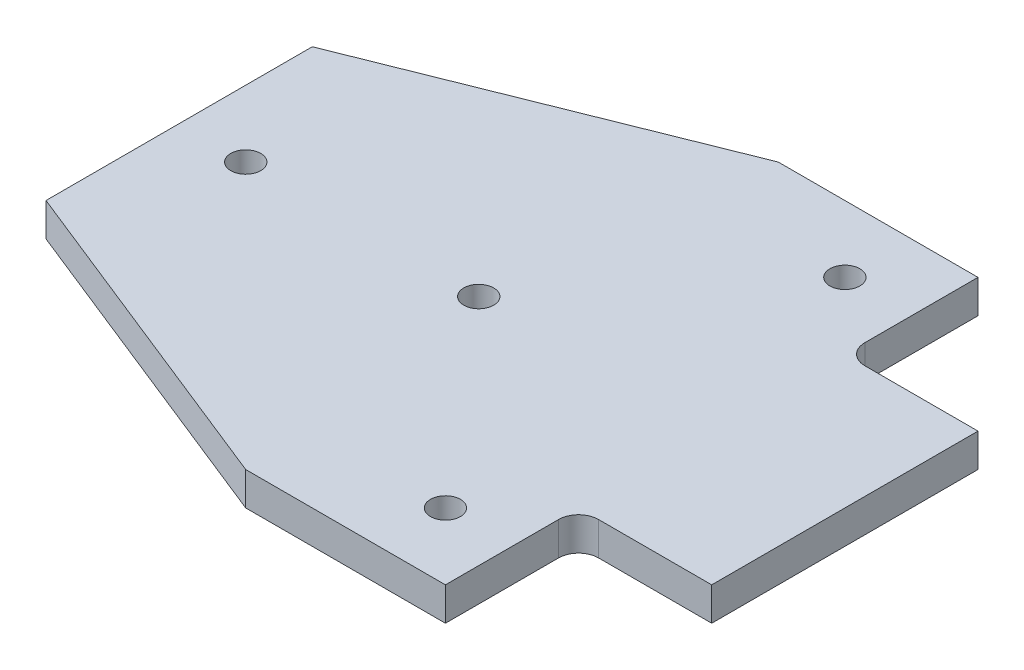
ISO-10303-21;
HEADER;
FILE_DESCRIPTION(('STEP AP214'),'2;1');
FILE_NAME('part.step','',(''),(''),'','','');
FILE_SCHEMA(('AUTOMOTIVE_DESIGN { 1 0 10303 214 1 1 1 1 }'));
ENDSEC;
DATA;
#1=APPLICATION_CONTEXT('core data for automotive mechanical design processes');
#2=APPLICATION_PROTOCOL_DEFINITION('international standard','automotive_design',2000,#1);
#3=PRODUCT_CONTEXT('',#1,'mechanical');
#4=PRODUCT('Part','Part','',(#3));
#5=PRODUCT_RELATED_PRODUCT_CATEGORY('part','',(#4));
#6=PRODUCT_DEFINITION_FORMATION('','',#4);
#7=PRODUCT_DEFINITION_CONTEXT('part definition',#1,'design');
#8=PRODUCT_DEFINITION('design','',#6,#7);
#9=PRODUCT_DEFINITION_SHAPE('','',#8);
#10=(LENGTH_UNIT() NAMED_UNIT(*) SI_UNIT(.MILLI.,.METRE.));
#11=(NAMED_UNIT(*) PLANE_ANGLE_UNIT() SI_UNIT($,.RADIAN.));
#12=(NAMED_UNIT(*) SI_UNIT($,.STERADIAN.) SOLID_ANGLE_UNIT());
#13=UNCERTAINTY_MEASURE_WITH_UNIT(LENGTH_MEASURE(1.E-05),#10,'distance_accuracy_value','');
#14=(GEOMETRIC_REPRESENTATION_CONTEXT(3) GLOBAL_UNCERTAINTY_ASSIGNED_CONTEXT((#13)) GLOBAL_UNIT_ASSIGNED_CONTEXT((#10,
#11,#12)) REPRESENTATION_CONTEXT('',''));
#15=CARTESIAN_POINT('',(0.,0.,0.));
#16=DIRECTION('',(0.,0.,1.));
#17=DIRECTION('',(1.,0.,0.));
#18=AXIS2_PLACEMENT_3D('',#15,#16,#17);
#19=CARTESIAN_POINT('',(83.,5.,-23.));
#20=DIRECTION('',(0.,-1.,0.));
#21=DIRECTION('',(0.,0.,-1.));
#22=AXIS2_PLACEMENT_3D('',#19,#20,#21);
#23=PLANE('',#22);
#24=CARTESIAN_POINT('',(70.,5.,-30.));
#25=DIRECTION('',(0.,1.,0.));
#26=DIRECTION('',(0.,0.,1.));
#27=AXIS2_PLACEMENT_3D('',#24,#25,#26);
#28=CIRCLE('',#27,2.25);
#29=CARTESIAN_POINT('',(70.,5.,-27.75));
#30=VERTEX_POINT('',#29);
#31=EDGE_CURVE('E290',#30,#30,#28,.T.);
#32=ORIENTED_EDGE('',*,*,#31,.F.);
#33=EDGE_LOOP('',(#32));
#34=FACE_BOUND('',#33,.T.);
#35=CARTESIAN_POINT('',(45.,5.,0.));
#36=DIRECTION('',(0.,1.,0.));
#37=DIRECTION('',(0.,0.,1.));
#38=AXIS2_PLACEMENT_3D('',#35,#36,#37);
#39=CIRCLE('',#38,2.25);
#40=CARTESIAN_POINT('',(45.,5.,2.25));
#41=VERTEX_POINT('',#40);
#42=EDGE_CURVE('E156',#41,#41,#39,.T.);
#43=ORIENTED_EDGE('',*,*,#42,.F.);
#44=EDGE_LOOP('',(#43));
#45=FACE_BOUND('',#44,.T.);
#46=DIRECTION('',(-1.,0.,0.));
#47=VECTOR('',#46,1.);
#48=CARTESIAN_POINT('',(100.,5.,-20.));
#49=LINE('',#48,#47);
#50=CARTESIAN_POINT('',(100.,5.,-20.));
#51=VERTEX_POINT('',#50);
#52=CARTESIAN_POINT('',(83.,5.,-20.));
#53=VERTEX_POINT('',#52);
#54=EDGE_CURVE('E175',#51,#53,#49,.T.);
#55=ORIENTED_EDGE('',*,*,#54,.T.);
#56=CARTESIAN_POINT('',(83.,5.,-23.));
#57=DIRECTION('',(0.,-1.,0.));
#58=DIRECTION('',(0.,0.,-1.));
#59=AXIS2_PLACEMENT_3D('',#56,#57,#58);
#60=CIRCLE('',#59,3.00000000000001);
#61=CARTESIAN_POINT('',(80.,5.,-23.));
#62=VERTEX_POINT('',#61);
#63=EDGE_CURVE('E103',#53,#62,#60,.T.);
#64=ORIENTED_EDGE('',*,*,#63,.T.);
#65=DIRECTION('',(0.,0.,-1.));
#66=VECTOR('',#65,1.);
#67=CARTESIAN_POINT('',(80.,5.,-23.));
#68=LINE('',#67,#66);
#69=CARTESIAN_POINT('',(80.,5.,-40.));
#70=VERTEX_POINT('',#69);
#71=EDGE_CURVE('E202',#62,#70,#68,.T.);
#72=ORIENTED_EDGE('',*,*,#71,.T.);
#73=DIRECTION('',(-1.,0.,0.));
#74=VECTOR('',#73,1.);
#75=CARTESIAN_POINT('',(80.,5.,-40.));
#76=LINE('',#75,#74);
#77=CARTESIAN_POINT('',(50.,5.,-40.));
#78=VERTEX_POINT('',#77);
#79=EDGE_CURVE('E221',#70,#78,#76,.T.);
#80=ORIENTED_EDGE('',*,*,#79,.T.);
#81=DIRECTION('',(-0.928476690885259,0.,0.371390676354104));
#82=VECTOR('',#81,1.);
#83=CARTESIAN_POINT('',(50.,5.,-40.));
#84=LINE('',#83,#82);
#85=CARTESIAN_POINT('',(0.,5.,-20.));
#86=VERTEX_POINT('',#85);
#87=EDGE_CURVE('E218',#78,#86,#84,.T.);
#88=ORIENTED_EDGE('',*,*,#87,.T.);
#89=DIRECTION('',(0.,0.,1.));
#90=VECTOR('',#89,1.);
#91=CARTESIAN_POINT('',(0.,5.,-20.));
#92=LINE('',#91,#90);
#93=CARTESIAN_POINT('',(0.,5.,20.));
#94=VERTEX_POINT('',#93);
#95=EDGE_CURVE('E220',#86,#94,#92,.T.);
#96=ORIENTED_EDGE('',*,*,#95,.T.);
#97=DIRECTION('',(0.928476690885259,0.,0.371390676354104));
#98=VECTOR('',#97,1.);
#99=CARTESIAN_POINT('',(50.,5.,40.));
#100=LINE('',#99,#98);
#101=CARTESIAN_POINT('',(50.,5.,40.));
#102=VERTEX_POINT('',#101);
#103=EDGE_CURVE('E223',#94,#102,#100,.T.);
#104=ORIENTED_EDGE('',*,*,#103,.T.);
#105=DIRECTION('',(1.,0.,0.));
#106=VECTOR('',#105,1.);
#107=CARTESIAN_POINT('',(79.9999999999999,5.,40.));
#108=LINE('',#107,#106);
#109=CARTESIAN_POINT('',(79.9999999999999,5.,40.));
#110=VERTEX_POINT('',#109);
#111=EDGE_CURVE('E229',#102,#110,#108,.T.);
#112=ORIENTED_EDGE('',*,*,#111,.T.);
#113=DIRECTION('',(0.,0.,-1.));
#114=VECTOR('',#113,1.);
#115=CARTESIAN_POINT('',(79.9999999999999,5.,23.));
#116=LINE('',#115,#114);
#117=CARTESIAN_POINT('',(80.,5.,23.));
#118=VERTEX_POINT('',#117);
#119=EDGE_CURVE('E134',#110,#118,#116,.T.);
#120=ORIENTED_EDGE('',*,*,#119,.T.);
#121=CARTESIAN_POINT('',(83.,5.,23.));
#122=DIRECTION('',(0.,-1.,0.));
#123=DIRECTION('',(0.,0.,1.));
#124=AXIS2_PLACEMENT_3D('',#121,#122,#123);
#125=CIRCLE('',#124,3.00000000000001);
#126=CARTESIAN_POINT('',(83.,5.,20.));
#127=VERTEX_POINT('',#126);
#128=EDGE_CURVE('E128',#118,#127,#125,.T.);
#129=ORIENTED_EDGE('',*,*,#128,.T.);
#130=DIRECTION('',(1.,0.,0.));
#131=VECTOR('',#130,1.);
#132=CARTESIAN_POINT('',(99.9999999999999,5.,20.));
#133=LINE('',#132,#131);
#134=CARTESIAN_POINT('',(99.9999999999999,5.,20.));
#135=VERTEX_POINT('',#134);
#136=EDGE_CURVE('E132',#127,#135,#133,.T.);
#137=ORIENTED_EDGE('',*,*,#136,.T.);
#138=DIRECTION('',(0.,0.,-1.));
#139=VECTOR('',#138,1.);
#140=CARTESIAN_POINT('',(99.9999999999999,5.,20.));
#141=LINE('',#140,#139);
#142=EDGE_CURVE('E48',#135,#51,#141,.T.);
#143=ORIENTED_EDGE('',*,*,#142,.T.);
#144=EDGE_LOOP('',(#55,#64,#72,#80,#88,#96,#104,#112,#120,#129,#137,#143));
#145=FACE_BOUND('',#144,.T.);
#146=CARTESIAN_POINT('',(10.,5.,0.));
#147=DIRECTION('',(0.,1.,0.));
#148=DIRECTION('',(0.,0.,1.));
#149=AXIS2_PLACEMENT_3D('',#146,#147,#148);
#150=CIRCLE('',#149,2.25);
#151=CARTESIAN_POINT('',(10.,5.,2.25));
#152=VERTEX_POINT('',#151);
#153=EDGE_CURVE('E296',#152,#152,#150,.T.);
#154=ORIENTED_EDGE('',*,*,#153,.F.);
#155=EDGE_LOOP('',(#154));
#156=FACE_BOUND('',#155,.T.);
#157=CARTESIAN_POINT('',(69.9999999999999,5.,30.));
#158=DIRECTION('',(0.,1.,0.));
#159=DIRECTION('',(0.,0.,-1.));
#160=AXIS2_PLACEMENT_3D('',#157,#158,#159);
#161=CIRCLE('',#160,2.25);
#162=CARTESIAN_POINT('',(69.9999999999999,5.,27.75));
#163=VERTEX_POINT('',#162);
#164=EDGE_CURVE('E281',#163,#163,#161,.T.);
#165=ORIENTED_EDGE('',*,*,#164,.F.);
#166=EDGE_LOOP('',(#165));
#167=FACE_BOUND('',#166,.T.);
#168=ADVANCED_FACE('F31',(#34,#45,#145,#156,#167),#23,.F.);
#169=CARTESIAN_POINT('',(83.,0.,-23.));
#170=DIRECTION('',(0.,-1.,0.));
#171=DIRECTION('',(0.,0.,-1.));
#172=AXIS2_PLACEMENT_3D('',#169,#170,#171);
#173=PLANE('',#172);
#174=CARTESIAN_POINT('',(70.,0.,-30.));
#175=DIRECTION('',(0.,1.,0.));
#176=DIRECTION('',(0.,0.,1.));
#177=AXIS2_PLACEMENT_3D('',#174,#175,#176);
#178=CIRCLE('',#177,2.25);
#179=CARTESIAN_POINT('',(70.,0.,-27.75));
#180=VERTEX_POINT('',#179);
#181=EDGE_CURVE('E287',#180,#180,#178,.T.);
#182=ORIENTED_EDGE('',*,*,#181,.T.);
#183=EDGE_LOOP('',(#182));
#184=FACE_BOUND('',#183,.T.);
#185=CARTESIAN_POINT('',(45.,0.,0.));
#186=DIRECTION('',(0.,1.,0.));
#187=DIRECTION('',(0.,0.,1.));
#188=AXIS2_PLACEMENT_3D('',#185,#186,#187);
#189=CIRCLE('',#188,2.25);
#190=CARTESIAN_POINT('',(45.,0.,2.25));
#191=VERTEX_POINT('',#190);
#192=EDGE_CURVE('E299',#191,#191,#189,.T.);
#193=ORIENTED_EDGE('',*,*,#192,.T.);
#194=EDGE_LOOP('',(#193));
#195=FACE_BOUND('',#194,.T.);
#196=DIRECTION('',(-1.,0.,0.));
#197=VECTOR('',#196,1.);
#198=CARTESIAN_POINT('',(100.,0.,-20.));
#199=LINE('',#198,#197);
#200=CARTESIAN_POINT('',(100.,0.,-20.));
#201=VERTEX_POINT('',#200);
#202=CARTESIAN_POINT('',(83.,0.,-20.));
#203=VERTEX_POINT('',#202);
#204=EDGE_CURVE('E152',#201,#203,#199,.T.);
#205=ORIENTED_EDGE('',*,*,#204,.F.);
#206=DIRECTION('',(0.,0.,-1.));
#207=VECTOR('',#206,1.);
#208=CARTESIAN_POINT('',(99.9999999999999,0.,20.));
#209=LINE('',#208,#207);
#210=CARTESIAN_POINT('',(99.9999999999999,0.,20.));
#211=VERTEX_POINT('',#210);
#212=EDGE_CURVE('E95',#211,#201,#209,.T.);
#213=ORIENTED_EDGE('',*,*,#212,.F.);
#214=DIRECTION('',(1.,0.,0.));
#215=VECTOR('',#214,1.);
#216=CARTESIAN_POINT('',(99.9999999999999,0.,20.));
#217=LINE('',#216,#215);
#218=CARTESIAN_POINT('',(83.,0.,20.));
#219=VERTEX_POINT('',#218);
#220=EDGE_CURVE('E89',#219,#211,#217,.T.);
#221=ORIENTED_EDGE('',*,*,#220,.F.);
#222=CARTESIAN_POINT('',(83.,0.,23.));
#223=DIRECTION('',(0.,-1.,0.));
#224=DIRECTION('',(0.,0.,1.));
#225=AXIS2_PLACEMENT_3D('',#222,#223,#224);
#226=CIRCLE('',#225,3.00000000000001);
#227=CARTESIAN_POINT('',(80.,0.,23.));
#228=VERTEX_POINT('',#227);
#229=EDGE_CURVE('E142',#228,#219,#226,.T.);
#230=ORIENTED_EDGE('',*,*,#229,.F.);
#231=DIRECTION('',(0.,0.,-1.));
#232=VECTOR('',#231,1.);
#233=CARTESIAN_POINT('',(79.9999999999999,0.,23.));
#234=LINE('',#233,#232);
#235=CARTESIAN_POINT('',(79.9999999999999,0.,40.));
#236=VERTEX_POINT('',#235);
#237=EDGE_CURVE('E170',#236,#228,#234,.T.);
#238=ORIENTED_EDGE('',*,*,#237,.F.);
#239=DIRECTION('',(1.,0.,0.));
#240=VECTOR('',#239,1.);
#241=CARTESIAN_POINT('',(79.9999999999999,0.,40.));
#242=LINE('',#241,#240);
#243=CARTESIAN_POINT('',(50.,0.,40.));
#244=VERTEX_POINT('',#243);
#245=EDGE_CURVE('E168',#244,#236,#242,.T.);
#246=ORIENTED_EDGE('',*,*,#245,.F.);
#247=DIRECTION('',(0.928476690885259,0.,0.371390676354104));
#248=VECTOR('',#247,1.);
#249=CARTESIAN_POINT('',(50.,0.,40.));
#250=LINE('',#249,#248);
#251=CARTESIAN_POINT('',(0.,0.,20.));
#252=VERTEX_POINT('',#251);
#253=EDGE_CURVE('E166',#252,#244,#250,.T.);
#254=ORIENTED_EDGE('',*,*,#253,.F.);
#255=DIRECTION('',(0.,0.,1.));
#256=VECTOR('',#255,1.);
#257=CARTESIAN_POINT('',(0.,0.,-20.));
#258=LINE('',#257,#256);
#259=CARTESIAN_POINT('',(0.,0.,-20.));
#260=VERTEX_POINT('',#259);
#261=EDGE_CURVE('E164',#260,#252,#258,.T.);
#262=ORIENTED_EDGE('',*,*,#261,.F.);
#263=DIRECTION('',(-0.928476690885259,0.,0.371390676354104));
#264=VECTOR('',#263,1.);
#265=CARTESIAN_POINT('',(50.,0.,-40.));
#266=LINE('',#265,#264);
#267=CARTESIAN_POINT('',(50.,0.,-40.));
#268=VERTEX_POINT('',#267);
#269=EDGE_CURVE('E162',#268,#260,#266,.T.);
#270=ORIENTED_EDGE('',*,*,#269,.F.);
#271=DIRECTION('',(-1.,0.,0.));
#272=VECTOR('',#271,1.);
#273=CARTESIAN_POINT('',(80.,0.,-40.));
#274=LINE('',#273,#272);
#275=CARTESIAN_POINT('',(80.,0.,-40.));
#276=VERTEX_POINT('',#275);
#277=EDGE_CURVE('E160',#276,#268,#274,.T.);
#278=ORIENTED_EDGE('',*,*,#277,.F.);
#279=DIRECTION('',(0.,0.,-1.));
#280=VECTOR('',#279,1.);
#281=CARTESIAN_POINT('',(80.,0.,-23.));
#282=LINE('',#281,#280);
#283=CARTESIAN_POINT('',(80.,0.,-23.));
#284=VERTEX_POINT('',#283);
#285=EDGE_CURVE('E158',#284,#276,#282,.T.);
#286=ORIENTED_EDGE('',*,*,#285,.F.);
#287=CARTESIAN_POINT('',(83.,0.,-23.));
#288=DIRECTION('',(0.,-1.,0.));
#289=DIRECTION('',(0.,0.,-1.));
#290=AXIS2_PLACEMENT_3D('',#287,#288,#289);
#291=CIRCLE('',#290,3.00000000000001);
#292=EDGE_CURVE('E155',#203,#284,#291,.T.);
#293=ORIENTED_EDGE('',*,*,#292,.F.);
#294=EDGE_LOOP('',(#205,#213,#221,#230,#238,#246,#254,#262,#270,#278,#286,#293));
#295=FACE_BOUND('',#294,.T.);
#296=CARTESIAN_POINT('',(10.,0.,0.));
#297=DIRECTION('',(0.,1.,0.));
#298=DIRECTION('',(0.,0.,1.));
#299=AXIS2_PLACEMENT_3D('',#296,#297,#298);
#300=CIRCLE('',#299,2.25);
#301=CARTESIAN_POINT('',(10.,0.,2.25));
#302=VERTEX_POINT('',#301);
#303=EDGE_CURVE('E293',#302,#302,#300,.T.);
#304=ORIENTED_EDGE('',*,*,#303,.T.);
#305=EDGE_LOOP('',(#304));
#306=FACE_BOUND('',#305,.T.);
#307=CARTESIAN_POINT('',(69.9999999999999,0.,30.));
#308=DIRECTION('',(0.,1.,0.));
#309=DIRECTION('',(0.,0.,-1.));
#310=AXIS2_PLACEMENT_3D('',#307,#308,#309);
#311=CIRCLE('',#310,2.25);
#312=CARTESIAN_POINT('',(69.9999999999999,0.,27.75));
#313=VERTEX_POINT('',#312);
#314=EDGE_CURVE('E284',#313,#313,#311,.T.);
#315=ORIENTED_EDGE('',*,*,#314,.T.);
#316=EDGE_LOOP('',(#315));
#317=FACE_BOUND('',#316,.T.);
#318=ADVANCED_FACE('F206',(#184,#195,#295,#306,#317),#173,.T.);
#319=CARTESIAN_POINT('',(100.,5.,-20.));
#320=DIRECTION('',(0.,0.,1.));
#321=DIRECTION('',(1.,0.,0.));
#322=AXIS2_PLACEMENT_3D('',#319,#320,#321);
#323=PLANE('',#322);
#324=ORIENTED_EDGE('',*,*,#204,.T.);
#325=DIRECTION('',(0.,-1.,0.));
#326=VECTOR('',#325,1.);
#327=CARTESIAN_POINT('',(83.,5.,-20.));
#328=LINE('',#327,#326);
#329=EDGE_CURVE('E11',#53,#203,#328,.T.);
#330=ORIENTED_EDGE('',*,*,#329,.F.);
#331=ORIENTED_EDGE('',*,*,#54,.F.);
#332=DIRECTION('',(0.,-1.,0.));
#333=VECTOR('',#332,1.);
#334=CARTESIAN_POINT('',(100.,5.,-20.));
#335=LINE('',#334,#333);
#336=EDGE_CURVE('E148',#51,#201,#335,.T.);
#337=ORIENTED_EDGE('',*,*,#336,.T.);
#338=EDGE_LOOP('',(#324,#330,#331,#337));
#339=FACE_BOUND('',#338,.T.);
#340=ADVANCED_FACE('F33',(#339),#323,.F.);
#341=CARTESIAN_POINT('',(83.,5.,-23.));
#342=DIRECTION('',(0.,-1.,0.));
#343=DIRECTION('',(0.,0.,-1.));
#344=AXIS2_PLACEMENT_3D('',#341,#342,#343);
#345=CYLINDRICAL_SURFACE('',#344,3.00000000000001);
#346=ORIENTED_EDGE('',*,*,#292,.T.);
#347=DIRECTION('',(0.,-1.,0.));
#348=VECTOR('',#347,1.);
#349=CARTESIAN_POINT('',(80.,5.,-23.));
#350=LINE('',#349,#348);
#351=EDGE_CURVE('E40',#62,#284,#350,.T.);
#352=ORIENTED_EDGE('',*,*,#351,.F.);
#353=ORIENTED_EDGE('',*,*,#63,.F.);
#354=ORIENTED_EDGE('',*,*,#329,.T.);
#355=EDGE_LOOP('',(#346,#352,#353,#354));
#356=FACE_BOUND('',#355,.T.);
#357=ADVANCED_FACE('F408',(#356),#345,.F.);
#358=CARTESIAN_POINT('',(80.,5.,-23.));
#359=DIRECTION('',(-1.,0.,0.));
#360=DIRECTION('',(0.,0.,1.));
#361=AXIS2_PLACEMENT_3D('',#358,#359,#360);
#362=PLANE('',#361);
#363=ORIENTED_EDGE('',*,*,#285,.T.);
#364=DIRECTION('',(0.,-1.,0.));
#365=VECTOR('',#364,1.);
#366=CARTESIAN_POINT('',(80.,5.,-40.));
#367=LINE('',#366,#365);
#368=EDGE_CURVE('E194',#70,#276,#367,.T.);
#369=ORIENTED_EDGE('',*,*,#368,.F.);
#370=ORIENTED_EDGE('',*,*,#71,.F.);
#371=ORIENTED_EDGE('',*,*,#351,.T.);
#372=EDGE_LOOP('',(#363,#369,#370,#371));
#373=FACE_BOUND('',#372,.T.);
#374=ADVANCED_FACE('F200',(#373),#362,.F.);
#375=CARTESIAN_POINT('',(80.,5.,-40.));
#376=DIRECTION('',(0.,0.,1.));
#377=DIRECTION('',(1.,0.,0.));
#378=AXIS2_PLACEMENT_3D('',#375,#376,#377);
#379=PLANE('',#378);
#380=ORIENTED_EDGE('',*,*,#277,.T.);
#381=DIRECTION('',(0.,-1.,0.));
#382=VECTOR('',#381,1.);
#383=CARTESIAN_POINT('',(50.,5.,-40.));
#384=LINE('',#383,#382);
#385=EDGE_CURVE('E191',#78,#268,#384,.T.);
#386=ORIENTED_EDGE('',*,*,#385,.F.);
#387=ORIENTED_EDGE('',*,*,#79,.F.);
#388=ORIENTED_EDGE('',*,*,#368,.T.);
#389=EDGE_LOOP('',(#380,#386,#387,#388));
#390=FACE_BOUND('',#389,.T.);
#391=ADVANCED_FACE('F212',(#390),#379,.F.);
#392=CARTESIAN_POINT('',(50.,5.,-40.));
#393=DIRECTION('',(0.371390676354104,0.,0.928476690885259));
#394=DIRECTION('',(0.928476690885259,0.,-0.371390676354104));
#395=AXIS2_PLACEMENT_3D('',#392,#393,#394);
#396=PLANE('',#395);
#397=ORIENTED_EDGE('',*,*,#269,.T.);
#398=DIRECTION('',(0.,-1.,0.));
#399=VECTOR('',#398,1.);
#400=CARTESIAN_POINT('',(0.,5.,-20.));
#401=LINE('',#400,#399);
#402=EDGE_CURVE('E188',#86,#260,#401,.T.);
#403=ORIENTED_EDGE('',*,*,#402,.F.);
#404=ORIENTED_EDGE('',*,*,#87,.F.);
#405=ORIENTED_EDGE('',*,*,#385,.T.);
#406=EDGE_LOOP('',(#397,#403,#404,#405));
#407=FACE_BOUND('',#406,.T.);
#408=ADVANCED_FACE('F216',(#407),#396,.F.);
#409=CARTESIAN_POINT('',(0.,5.,-20.));
#410=DIRECTION('',(1.,0.,0.));
#411=DIRECTION('',(0.,0.,-1.));
#412=AXIS2_PLACEMENT_3D('',#409,#410,#411);
#413=PLANE('',#412);
#414=ORIENTED_EDGE('',*,*,#261,.T.);
#415=DIRECTION('',(0.,-1.,0.));
#416=VECTOR('',#415,1.);
#417=CARTESIAN_POINT('',(0.,5.,20.));
#418=LINE('',#417,#416);
#419=EDGE_CURVE('E185',#94,#252,#418,.T.);
#420=ORIENTED_EDGE('',*,*,#419,.F.);
#421=ORIENTED_EDGE('',*,*,#95,.F.);
#422=ORIENTED_EDGE('',*,*,#402,.T.);
#423=EDGE_LOOP('',(#414,#420,#421,#422));
#424=FACE_BOUND('',#423,.T.);
#425=ADVANCED_FACE('F373',(#424),#413,.F.);
#426=CARTESIAN_POINT('',(50.,5.,40.));
#427=DIRECTION('',(0.371390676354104,0.,-0.928476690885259));
#428=DIRECTION('',(-0.928476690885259,0.,-0.371390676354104));
#429=AXIS2_PLACEMENT_3D('',#426,#427,#428);
#430=PLANE('',#429);
#431=ORIENTED_EDGE('',*,*,#253,.T.);
#432=DIRECTION('',(0.,-1.,0.));
#433=VECTOR('',#432,1.);
#434=CARTESIAN_POINT('',(50.,5.,40.));
#435=LINE('',#434,#433);
#436=EDGE_CURVE('E182',#102,#244,#435,.T.);
#437=ORIENTED_EDGE('',*,*,#436,.F.);
#438=ORIENTED_EDGE('',*,*,#103,.F.);
#439=ORIENTED_EDGE('',*,*,#419,.T.);
#440=EDGE_LOOP('',(#431,#437,#438,#439));
#441=FACE_BOUND('',#440,.T.);
#442=ADVANCED_FACE('F364',(#441),#430,.F.);
#443=CARTESIAN_POINT('',(79.9999999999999,5.,40.));
#444=DIRECTION('',(0.,0.,-1.));
#445=DIRECTION('',(-1.,0.,0.));
#446=AXIS2_PLACEMENT_3D('',#443,#444,#445);
#447=PLANE('',#446);
#448=ORIENTED_EDGE('',*,*,#245,.T.);
#449=DIRECTION('',(0.,-1.,0.));
#450=VECTOR('',#449,1.);
#451=CARTESIAN_POINT('',(79.9999999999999,5.,40.));
#452=LINE('',#451,#450);
#453=EDGE_CURVE('E179',#110,#236,#452,.T.);
#454=ORIENTED_EDGE('',*,*,#453,.F.);
#455=ORIENTED_EDGE('',*,*,#111,.F.);
#456=ORIENTED_EDGE('',*,*,#436,.T.);
#457=EDGE_LOOP('',(#448,#454,#455,#456));
#458=FACE_BOUND('',#457,.T.);
#459=ADVANCED_FACE('F235',(#458),#447,.F.);
#460=CARTESIAN_POINT('',(79.9999999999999,5.,23.));
#461=DIRECTION('',(-1.,0.,0.));
#462=DIRECTION('',(0.,0.,1.));
#463=AXIS2_PLACEMENT_3D('',#460,#461,#462);
#464=PLANE('',#463);
#465=ORIENTED_EDGE('',*,*,#237,.T.);
#466=DIRECTION('',(0.,-1.,0.));
#467=VECTOR('',#466,1.);
#468=CARTESIAN_POINT('',(80.,5.,23.));
#469=LINE('',#468,#467);
#470=EDGE_CURVE('E143',#118,#228,#469,.T.);
#471=ORIENTED_EDGE('',*,*,#470,.F.);
#472=ORIENTED_EDGE('',*,*,#119,.F.);
#473=ORIENTED_EDGE('',*,*,#453,.T.);
#474=EDGE_LOOP('',(#465,#471,#472,#473));
#475=FACE_BOUND('',#474,.T.);
#476=ADVANCED_FACE('F239',(#475),#464,.F.);
#477=CARTESIAN_POINT('',(83.,5.,23.));
#478=DIRECTION('',(0.,-1.,0.));
#479=DIRECTION('',(0.,0.,-1.));
#480=AXIS2_PLACEMENT_3D('',#477,#478,#479);
#481=CYLINDRICAL_SURFACE('',#480,3.00000000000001);
#482=ORIENTED_EDGE('',*,*,#229,.T.);
#483=DIRECTION('',(0.,-1.,0.));
#484=VECTOR('',#483,1.);
#485=CARTESIAN_POINT('',(83.,5.,20.));
#486=LINE('',#485,#484);
#487=EDGE_CURVE('E139',#127,#219,#486,.T.);
#488=ORIENTED_EDGE('',*,*,#487,.F.);
#489=ORIENTED_EDGE('',*,*,#128,.F.);
#490=ORIENTED_EDGE('',*,*,#470,.T.);
#491=EDGE_LOOP('',(#482,#488,#489,#490));
#492=FACE_BOUND('',#491,.T.);
#493=ADVANCED_FACE('F140',(#492),#481,.F.);
#494=CARTESIAN_POINT('',(99.9999999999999,5.,20.));
#495=DIRECTION('',(0.,0.,-1.));
#496=DIRECTION('',(-1.,0.,0.));
#497=AXIS2_PLACEMENT_3D('',#494,#495,#496);
#498=PLANE('',#497);
#499=ORIENTED_EDGE('',*,*,#220,.T.);
#500=DIRECTION('',(0.,-1.,0.));
#501=VECTOR('',#500,1.);
#502=CARTESIAN_POINT('',(99.9999999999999,5.,20.));
#503=LINE('',#502,#501);
#504=EDGE_CURVE('E144',#135,#211,#503,.T.);
#505=ORIENTED_EDGE('',*,*,#504,.F.);
#506=ORIENTED_EDGE('',*,*,#136,.F.);
#507=ORIENTED_EDGE('',*,*,#487,.T.);
#508=EDGE_LOOP('',(#499,#505,#506,#507));
#509=FACE_BOUND('',#508,.T.);
#510=ADVANCED_FACE('F146',(#509),#498,.F.);
#511=CARTESIAN_POINT('',(99.9999999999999,5.,20.));
#512=DIRECTION('',(-1.,0.,0.));
#513=DIRECTION('',(0.,0.,1.));
#514=AXIS2_PLACEMENT_3D('',#511,#512,#513);
#515=PLANE('',#514);
#516=ORIENTED_EDGE('',*,*,#212,.T.);
#517=ORIENTED_EDGE('',*,*,#336,.F.);
#518=ORIENTED_EDGE('',*,*,#142,.F.);
#519=ORIENTED_EDGE('',*,*,#504,.T.);
#520=EDGE_LOOP('',(#516,#517,#518,#519));
#521=FACE_BOUND('',#520,.T.);
#522=ADVANCED_FACE('F243',(#521),#515,.F.);
#523=CARTESIAN_POINT('',(45.,5.,0.));
#524=DIRECTION('',(0.,-1.,0.));
#525=DIRECTION('',(0.,0.,-1.));
#526=AXIS2_PLACEMENT_3D('',#523,#524,#525);
#527=CYLINDRICAL_SURFACE('',#526,2.25);
#528=ORIENTED_EDGE('',*,*,#42,.T.);
#529=EDGE_LOOP('',(#528));
#530=FACE_BOUND('',#529,.T.);
#531=ORIENTED_EDGE('',*,*,#192,.F.);
#532=EDGE_LOOP('',(#531));
#533=FACE_BOUND('',#532,.T.);
#534=ADVANCED_FACE('F245',(#530,#533),#527,.F.);
#535=CARTESIAN_POINT('',(10.,5.,0.));
#536=DIRECTION('',(0.,-1.,0.));
#537=DIRECTION('',(0.,0.,-1.));
#538=AXIS2_PLACEMENT_3D('',#535,#536,#537);
#539=CYLINDRICAL_SURFACE('',#538,2.25);
#540=ORIENTED_EDGE('',*,*,#153,.T.);
#541=EDGE_LOOP('',(#540));
#542=FACE_BOUND('',#541,.T.);
#543=ORIENTED_EDGE('',*,*,#303,.F.);
#544=EDGE_LOOP('',(#543));
#545=FACE_BOUND('',#544,.T.);
#546=ADVANCED_FACE('F251',(#542,#545),#539,.F.);
#547=CARTESIAN_POINT('',(70.,5.,-30.));
#548=DIRECTION('',(0.,-1.,0.));
#549=DIRECTION('',(0.,0.,-1.));
#550=AXIS2_PLACEMENT_3D('',#547,#548,#549);
#551=CYLINDRICAL_SURFACE('',#550,2.25);
#552=ORIENTED_EDGE('',*,*,#31,.T.);
#553=EDGE_LOOP('',(#552));
#554=FACE_BOUND('',#553,.T.);
#555=ORIENTED_EDGE('',*,*,#181,.F.);
#556=EDGE_LOOP('',(#555));
#557=FACE_BOUND('',#556,.T.);
#558=ADVANCED_FACE('F268',(#554,#557),#551,.F.);
#559=CARTESIAN_POINT('',(69.9999999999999,5.,30.));
#560=DIRECTION('',(0.,-1.,0.));
#561=DIRECTION('',(0.,0.,-1.));
#562=AXIS2_PLACEMENT_3D('',#559,#560,#561);
#563=CYLINDRICAL_SURFACE('',#562,2.25);
#564=ORIENTED_EDGE('',*,*,#164,.T.);
#565=EDGE_LOOP('',(#564));
#566=FACE_BOUND('',#565,.T.);
#567=ORIENTED_EDGE('',*,*,#314,.F.);
#568=EDGE_LOOP('',(#567));
#569=FACE_BOUND('',#568,.T.);
#570=ADVANCED_FACE('F272',(#566,#569),#563,.F.);
#571=CLOSED_SHELL('',(#168,#318,#340,#357,#374,#391,#408,#425,#442,#459,#476,#493,#510,#522,
#534,#546,#558,#570));
#572=MANIFOLD_SOLID_BREP('B2',#571);
#573=ADVANCED_BREP_SHAPE_REPRESENTATION('',(#18,#572),#14);
#574=SHAPE_DEFINITION_REPRESENTATION(#9,#573);
ENDSEC;
END-ISO-10303-21;
